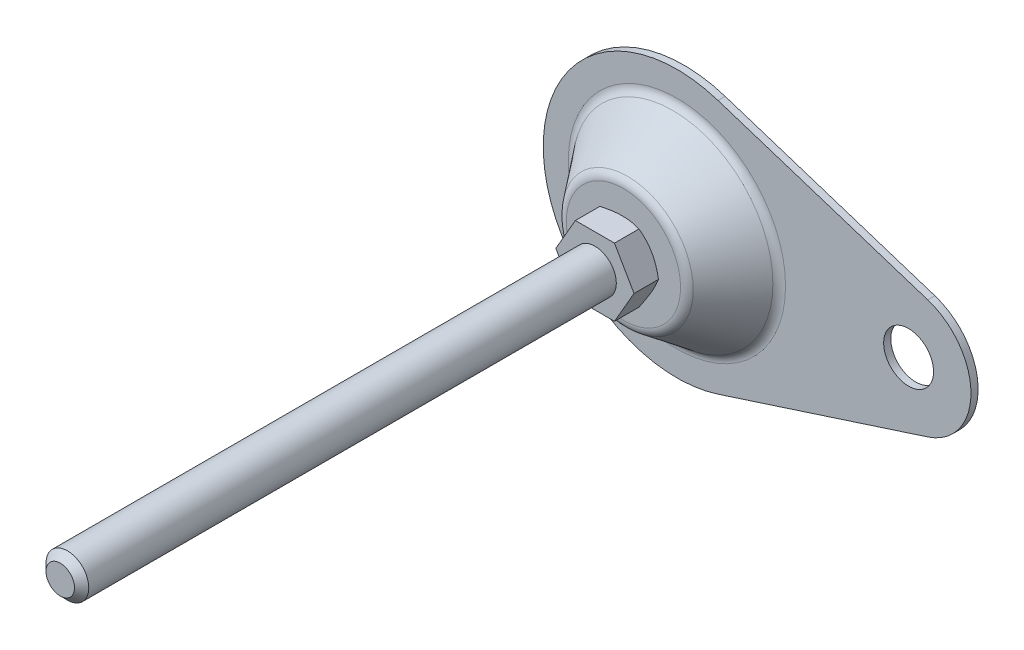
ISO-10303-21;
HEADER;
FILE_DESCRIPTION(('STEP AP214'),'2;1');
FILE_NAME('part.step','',(''),(''),'','','');
FILE_SCHEMA(('AUTOMOTIVE_DESIGN { 1 0 10303 214 1 1 1 1 }'));
ENDSEC;
DATA;
#1=APPLICATION_CONTEXT('core data for automotive mechanical design processes');
#2=APPLICATION_PROTOCOL_DEFINITION('international standard','automotive_design',2000,#1);
#3=PRODUCT_CONTEXT('',#1,'mechanical');
#4=PRODUCT('Part','Part','',(#3));
#5=PRODUCT_RELATED_PRODUCT_CATEGORY('part','',(#4));
#6=PRODUCT_DEFINITION_FORMATION('','',#4);
#7=PRODUCT_DEFINITION_CONTEXT('part definition',#1,'design');
#8=PRODUCT_DEFINITION('design','',#6,#7);
#9=PRODUCT_DEFINITION_SHAPE('','',#8);
#10=(LENGTH_UNIT() NAMED_UNIT(*) SI_UNIT(.MILLI.,.METRE.));
#11=(NAMED_UNIT(*) PLANE_ANGLE_UNIT() SI_UNIT($,.RADIAN.));
#12=(NAMED_UNIT(*) SI_UNIT($,.STERADIAN.) SOLID_ANGLE_UNIT());
#13=UNCERTAINTY_MEASURE_WITH_UNIT(LENGTH_MEASURE(1.E-05),#10,'distance_accuracy_value','');
#14=(GEOMETRIC_REPRESENTATION_CONTEXT(3) GLOBAL_UNCERTAINTY_ASSIGNED_CONTEXT((#13)) GLOBAL_UNIT_ASSIGNED_CONTEXT((#10,
#11,#12)) REPRESENTATION_CONTEXT('',''));
#15=CARTESIAN_POINT('',(0.,0.,0.));
#16=DIRECTION('',(0.,0.,1.));
#17=DIRECTION('',(1.,0.,0.));
#18=AXIS2_PLACEMENT_3D('',#15,#16,#17);
#19=CARTESIAN_POINT('',(65.,0.,2.));
#20=DIRECTION('',(0.,0.,1.));
#21=DIRECTION('',(1.,0.,0.));
#22=AXIS2_PLACEMENT_3D('',#19,#20,#21);
#23=PLANE('',#22);
#24=CARTESIAN_POINT('',(0.,0.,2.));
#25=DIRECTION('',(0.,0.,1.));
#26=DIRECTION('',(1.,0.,0.));
#27=AXIS2_PLACEMENT_3D('',#24,#25,#26);
#28=CIRCLE('',#27,30.4802116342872);
#29=CARTESIAN_POINT('',(30.4802116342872,0.,2.));
#30=VERTEX_POINT('',#29);
#31=EDGE_CURVE('E245',#30,#30,#28,.F.);
#32=ORIENTED_EDGE('',*,*,#31,.T.);
#33=EDGE_LOOP('',(#32));
#34=FACE_BOUND('',#33,.T.);
#35=CARTESIAN_POINT('',(65.,0.,2.));
#36=DIRECTION('',(0.,0.,1.));
#37=DIRECTION('',(1.,0.,0.));
#38=AXIS2_PLACEMENT_3D('',#35,#36,#37);
#39=CIRCLE('',#38,7.);
#40=CARTESIAN_POINT('',(72.,0.,2.));
#41=VERTEX_POINT('',#40);
#42=EDGE_CURVE('E262',#41,#41,#39,.T.);
#43=ORIENTED_EDGE('',*,*,#42,.F.);
#44=EDGE_LOOP('',(#43));
#45=FACE_BOUND('',#44,.T.);
#46=DIRECTION('',(-0.951485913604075,0.307692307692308,0.));
#47=VECTOR('',#46,1.);
#48=CARTESIAN_POINT('',(11.5384615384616,35.6807217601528,2.));
#49=LINE('',#48,#47);
#50=CARTESIAN_POINT('',(70.3846153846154,16.6510034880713,2.));
#51=VERTEX_POINT('',#50);
#52=CARTESIAN_POINT('',(11.5384615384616,35.6807217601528,2.));
#53=VERTEX_POINT('',#52);
#54=EDGE_CURVE('E112',#51,#53,#49,.T.);
#55=ORIENTED_EDGE('',*,*,#54,.T.);
#56=CARTESIAN_POINT('',(0.,0.,2.));
#57=DIRECTION('',(0.,0.,1.));
#58=DIRECTION('',(1.,0.,0.));
#59=AXIS2_PLACEMENT_3D('',#56,#57,#58);
#60=CIRCLE('',#59,37.5);
#61=CARTESIAN_POINT('',(11.5384615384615,-35.6807217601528,2.));
#62=VERTEX_POINT('',#61);
#63=EDGE_CURVE('E114',#53,#62,#60,.T.);
#64=ORIENTED_EDGE('',*,*,#63,.T.);
#65=DIRECTION('',(0.951485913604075,0.307692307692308,0.));
#66=VECTOR('',#65,1.);
#67=CARTESIAN_POINT('',(11.5384615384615,-35.6807217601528,2.));
#68=LINE('',#67,#66);
#69=CARTESIAN_POINT('',(70.3846153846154,-16.6510034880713,2.));
#70=VERTEX_POINT('',#69);
#71=EDGE_CURVE('E97',#62,#70,#68,.T.);
#72=ORIENTED_EDGE('',*,*,#71,.T.);
#73=CARTESIAN_POINT('',(65.,0.,2.));
#74=DIRECTION('',(0.,0.,1.));
#75=DIRECTION('',(1.,0.,0.));
#76=AXIS2_PLACEMENT_3D('',#73,#74,#75);
#77=CIRCLE('',#76,17.5);
#78=EDGE_CURVE('E106',#70,#51,#77,.T.);
#79=ORIENTED_EDGE('',*,*,#78,.T.);
#80=EDGE_LOOP('',(#55,#64,#72,#79));
#81=FACE_BOUND('',#80,.T.);
#82=ADVANCED_FACE('F14',(#34,#45,#81),#23,.T.);
#83=CARTESIAN_POINT('',(65.,0.,0.));
#84=DIRECTION('',(0.,0.,1.));
#85=DIRECTION('',(1.,0.,0.));
#86=AXIS2_PLACEMENT_3D('',#83,#84,#85);
#87=PLANE('',#86);
#88=CARTESIAN_POINT('',(65.,0.,0.));
#89=DIRECTION('',(0.,0.,1.));
#90=DIRECTION('',(1.,0.,0.));
#91=AXIS2_PLACEMENT_3D('',#88,#89,#90);
#92=CIRCLE('',#91,7.);
#93=CARTESIAN_POINT('',(72.,0.,0.));
#94=VERTEX_POINT('',#93);
#95=EDGE_CURVE('E258',#94,#94,#92,.T.);
#96=ORIENTED_EDGE('',*,*,#95,.T.);
#97=EDGE_LOOP('',(#96));
#98=FACE_BOUND('',#97,.T.);
#99=CARTESIAN_POINT('',(0.,0.,0.));
#100=DIRECTION('',(0.,0.,1.));
#101=DIRECTION('',(1.,0.,0.));
#102=AXIS2_PLACEMENT_3D('',#99,#100,#101);
#103=CIRCLE('',#102,37.5);
#104=CARTESIAN_POINT('',(11.5384615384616,35.6807217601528,0.));
#105=VERTEX_POINT('',#104);
#106=CARTESIAN_POINT('',(11.5384615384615,-35.6807217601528,0.));
#107=VERTEX_POINT('',#106);
#108=EDGE_CURVE('E275',#105,#107,#103,.T.);
#109=ORIENTED_EDGE('',*,*,#108,.F.);
#110=DIRECTION('',(-0.951485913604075,0.307692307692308,0.));
#111=VECTOR('',#110,1.);
#112=CARTESIAN_POINT('',(70.3846153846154,16.6510034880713,0.));
#113=LINE('',#112,#111);
#114=CARTESIAN_POINT('',(70.3846153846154,16.6510034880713,0.));
#115=VERTEX_POINT('',#114);
#116=EDGE_CURVE('E9',#115,#105,#113,.T.);
#117=ORIENTED_EDGE('',*,*,#116,.F.);
#118=CARTESIAN_POINT('',(65.,0.,0.));
#119=DIRECTION('',(0.,0.,1.));
#120=DIRECTION('',(1.,0.,0.));
#121=AXIS2_PLACEMENT_3D('',#118,#119,#120);
#122=CIRCLE('',#121,17.5);
#123=CARTESIAN_POINT('',(70.3846153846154,-16.6510034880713,0.));
#124=VERTEX_POINT('',#123);
#125=EDGE_CURVE('E22',#124,#115,#122,.T.);
#126=ORIENTED_EDGE('',*,*,#125,.F.);
#127=DIRECTION('',(0.951485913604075,0.307692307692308,0.));
#128=VECTOR('',#127,1.);
#129=CARTESIAN_POINT('',(70.3846153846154,-16.6510034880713,0.));
#130=LINE('',#129,#128);
#131=EDGE_CURVE('E99',#107,#124,#130,.T.);
#132=ORIENTED_EDGE('',*,*,#131,.F.);
#133=EDGE_LOOP('',(#109,#117,#126,#132));
#134=FACE_BOUND('',#133,.T.);
#135=ADVANCED_FACE('F215',(#98,#134),#87,.F.);
#136=CARTESIAN_POINT('',(0.,0.,17.));
#137=DIRECTION('',(0.,0.,-1.));
#138=DIRECTION('',(-1.,0.,0.));
#139=AXIS2_PLACEMENT_3D('',#136,#137,#138);
#140=PLANE('',#139);
#141=CARTESIAN_POINT('',(0.,0.,17.));
#142=DIRECTION('',(0.,0.,-1.));
#143=DIRECTION('',(-1.,0.,0.));
#144=AXIS2_PLACEMENT_3D('',#141,#142,#143);
#145=CIRCLE('',#144,9.);
#146=CARTESIAN_POINT('',(-9.,0.,17.));
#147=VERTEX_POINT('',#146);
#148=EDGE_CURVE('E122',#147,#147,#145,.T.);
#149=ORIENTED_EDGE('',*,*,#148,.T.);
#150=EDGE_LOOP('',(#149));
#151=FACE_BOUND('',#150,.T.);
#152=CARTESIAN_POINT('',(0.,0.,17.));
#153=DIRECTION('',(0.,0.,-1.));
#154=DIRECTION('',(-1.,0.,0.));
#155=AXIS2_PLACEMENT_3D('',#152,#153,#154);
#156=CIRCLE('',#155,16.0197883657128);
#157=CARTESIAN_POINT('',(-16.0197883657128,0.,17.));
#158=VERTEX_POINT('',#157);
#159=EDGE_CURVE('E278',#158,#158,#156,.F.);
#160=ORIENTED_EDGE('',*,*,#159,.T.);
#161=EDGE_LOOP('',(#160));
#162=FACE_BOUND('',#161,.T.);
#163=ADVANCED_FACE('F211',(#151,#162),#140,.F.);
#164=CARTESIAN_POINT('',(0.,0.,5.));
#165=DIRECTION('',(0.,0.,1.));
#166=DIRECTION('',(1.,0.,0.));
#167=AXIS2_PLACEMENT_3D('',#164,#165,#166);
#168=TOROIDAL_SURFACE('',#167,30.4802116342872,3.);
#169=CARTESIAN_POINT('',(0.,0.,3.1747053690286));
#170=DIRECTION('',(0.,0.,1.));
#171=DIRECTION('',(1.,0.,0.));
#172=AXIS2_PLACEMENT_3D('',#169,#170,#171);
#173=CIRCLE('',#172,28.0993925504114);
#174=CARTESIAN_POINT('',(28.0993925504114,0.,3.1747053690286));
#175=VERTEX_POINT('',#174);
#176=EDGE_CURVE('E242',#175,#175,#173,.T.);
#177=ORIENTED_EDGE('',*,*,#176,.F.);
#178=EDGE_LOOP('',(#177));
#179=FACE_BOUND('',#178,.T.);
#180=ORIENTED_EDGE('',*,*,#31,.F.);
#181=EDGE_LOOP('',(#180));
#182=FACE_BOUND('',#181,.T.);
#183=ADVANCED_FACE('F214',(#179,#182),#168,.F.);
#184=CARTESIAN_POINT('',(0.,0.,14.));
#185=DIRECTION('',(0.,0.,-1.));
#186=DIRECTION('',(-1.,0.,0.));
#187=AXIS2_PLACEMENT_3D('',#184,#185,#186);
#188=TOROIDAL_SURFACE('',#187,16.0197883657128,3.);
#189=ORIENTED_EDGE('',*,*,#159,.F.);
#190=EDGE_LOOP('',(#189));
#191=FACE_BOUND('',#190,.T.);
#192=CARTESIAN_POINT('',(0.,0.,15.8252946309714));
#193=DIRECTION('',(0.,0.,1.));
#194=DIRECTION('',(1.,0.,0.));
#195=AXIS2_PLACEMENT_3D('',#192,#193,#194);
#196=CIRCLE('',#195,18.4006074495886);
#197=CARTESIAN_POINT('',(18.4006074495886,0.,15.8252946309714));
#198=VERTEX_POINT('',#197);
#199=EDGE_CURVE('E251',#198,#198,#196,.F.);
#200=ORIENTED_EDGE('',*,*,#199,.F.);
#201=EDGE_LOOP('',(#200));
#202=FACE_BOUND('',#201,.T.);
#203=ADVANCED_FACE('F229',(#191,#202),#188,.T.);
#204=CARTESIAN_POINT('',(0.,0.,2.));
#205=DIRECTION('',(0.,0.,-1.));
#206=DIRECTION('',(-1.,0.,0.));
#207=AXIS2_PLACEMENT_3D('',#204,#205,#206);
#208=CYLINDRICAL_SURFACE('',#207,37.5);
#209=ORIENTED_EDGE('',*,*,#108,.T.);
#210=DIRECTION('',(0.,0.,1.));
#211=VECTOR('',#210,1.);
#212=CARTESIAN_POINT('',(11.5384615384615,-35.6807217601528,-8.));
#213=LINE('',#212,#211);
#214=EDGE_CURVE('E103',#107,#62,#213,.T.);
#215=ORIENTED_EDGE('',*,*,#214,.T.);
#216=ORIENTED_EDGE('',*,*,#63,.F.);
#217=DIRECTION('',(0.,0.,1.));
#218=VECTOR('',#217,1.);
#219=CARTESIAN_POINT('',(11.5384615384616,35.6807217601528,-8.));
#220=LINE('',#219,#218);
#221=EDGE_CURVE('E119',#105,#53,#220,.T.);
#222=ORIENTED_EDGE('',*,*,#221,.F.);
#223=EDGE_LOOP('',(#209,#215,#216,#222));
#224=FACE_BOUND('',#223,.T.);
#225=ADVANCED_FACE('F219',(#224),#208,.T.);
#226=CARTESIAN_POINT('',(65.,0.,2.));
#227=DIRECTION('',(0.,0.,-1.));
#228=DIRECTION('',(-1.,0.,0.));
#229=AXIS2_PLACEMENT_3D('',#226,#227,#228);
#230=CYLINDRICAL_SURFACE('',#229,7.);
#231=ORIENTED_EDGE('',*,*,#42,.T.);
#232=EDGE_LOOP('',(#231));
#233=FACE_BOUND('',#232,.T.);
#234=ORIENTED_EDGE('',*,*,#95,.F.);
#235=EDGE_LOOP('',(#234));
#236=FACE_BOUND('',#235,.T.);
#237=ADVANCED_FACE('F209',(#233,#236),#230,.F.);
#238=CARTESIAN_POINT('',(0.,0.,2.));
#239=DIRECTION('',(0.,0.,-1.));
#240=DIRECTION('',(-1.,0.,0.));
#241=AXIS2_PLACEMENT_3D('',#238,#239,#240);
#242=CONICAL_SURFACE('',#241,29.,0.654082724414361);
#243=ORIENTED_EDGE('',*,*,#176,.T.);
#244=EDGE_LOOP('',(#243));
#245=FACE_BOUND('',#244,.T.);
#246=ORIENTED_EDGE('',*,*,#199,.T.);
#247=EDGE_LOOP('',(#246));
#248=FACE_BOUND('',#247,.T.);
#249=ADVANCED_FACE('F151',(#245,#248),#242,.T.);
#250=CARTESIAN_POINT('',(0.,0.,17.));
#251=DIRECTION('',(0.,0.,1.));
#252=DIRECTION('',(1.,0.,0.));
#253=AXIS2_PLACEMENT_3D('',#250,#251,#252);
#254=CONICAL_SURFACE('',#253,9.,1.0471975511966);
#255=ORIENTED_EDGE('',*,*,#148,.F.);
#256=EDGE_LOOP('',(#255));
#257=FACE_BOUND('',#256,.T.);
#258=CARTESIAN_POINT('',(10.9697705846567,0.000200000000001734,18.137247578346));
#259=CARTESIAN_POINT('',(10.8492020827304,-0.2086307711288,18.0676485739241));
#260=CARTESIAN_POINT('',(10.7281840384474,-0.418240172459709,18.0012084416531));
#261=CARTESIAN_POINT('',(10.4851774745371,-0.839139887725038,17.8755224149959));
#262=CARTESIAN_POINT('',(10.3631886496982,-1.05043073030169,17.8162788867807));
#263=CARTESIAN_POINT('',(9.99525656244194,-1.68770779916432,17.6504897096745));
#264=CARTESIAN_POINT('',(9.74786083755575,-2.11620976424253,17.5561895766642));
#265=CARTESIAN_POINT('',(9.37764446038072,-2.75744333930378,17.4456138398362));
#266=CARTESIAN_POINT('',(9.2559298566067,-2.96825921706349,17.4141149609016));
#267=CARTESIAN_POINT('',(9.01193711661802,-3.39086703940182,17.3612933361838));
#268=CARTESIAN_POINT('',(8.88965896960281,-3.60265900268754,17.3399707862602));
#269=CARTESIAN_POINT('',(8.64489870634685,-4.02659621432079,17.3080481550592));
#270=CARTESIAN_POINT('',(8.52241700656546,-4.23874074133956,17.2974353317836));
#271=CARTESIAN_POINT('',(8.27734047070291,-4.66322575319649,17.2871576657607));
#272=CARTESIAN_POINT('',(8.15474563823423,-4.87556623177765,17.2874924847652));
#273=CARTESIAN_POINT('',(7.92555157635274,-5.27254199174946,17.2983485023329));
#274=CARTESIAN_POINT('',(7.81893617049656,-5.45720529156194,17.3075454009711));
#275=CARTESIAN_POINT('',(7.60595470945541,-5.82610000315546,17.3340405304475));
#276=CARTESIAN_POINT('',(7.49958867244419,-6.01033138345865,17.3513393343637));
#277=CARTESIAN_POINT('',(7.18090270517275,-6.56231167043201,17.414979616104));
#278=CARTESIAN_POINT('',(6.96914687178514,-6.92908353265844,17.4730570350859));
#279=CARTESIAN_POINT('',(6.5433889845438,-7.66651782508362,17.6182511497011));
#280=CARTESIAN_POINT('',(6.32944126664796,-8.03708614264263,17.7059833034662));
#281=CARTESIAN_POINT('',(5.90473630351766,-8.77269671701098,17.9050988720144));
#282=CARTESIAN_POINT('',(5.69397361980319,-9.137748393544,18.0164355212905));
#283=CARTESIAN_POINT('',(5.48471208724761,-9.5002,18.137247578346));
#284=B_SPLINE_CURVE_WITH_KNOTS('',3,(#258,#259,#260,#261,#262,#263,#264,#265,#266,#267,#268,
#269,#270,#271,#272,#273,#274,#275,#276,#277,#278,#279,#280,#281,#282,#283),.UNSPECIFIED.,.F.,
.F.,(4,2,2,2,2,2,2,2,2,2,2,2,4),(0.,0.752880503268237,1.50600787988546,3.0154687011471,
3.75167336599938,4.48789219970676,5.22323407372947,5.95855322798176,6.59868084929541,
7.23885375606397,8.52010929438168,9.82978009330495,11.1368800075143),.UNSPECIFIED.);
#285=CARTESIAN_POINT('',(10.9696551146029,0.,18.1371809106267));
#286=VERTEX_POINT('',#285);
#287=CARTESIAN_POINT('',(5.48482755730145,-9.5,18.1371809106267));
#288=VERTEX_POINT('',#287);
#289=EDGE_CURVE('E29',#286,#288,#284,.T.);
#290=ORIENTED_EDGE('',*,*,#289,.T.);
#291=CARTESIAN_POINT('',(-14.6955632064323,-9.5,21.9068104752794));
#292=CARTESIAN_POINT('',(-14.4882598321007,-9.5,21.806299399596));
#293=CARTESIAN_POINT('',(-14.2807121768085,-9.5,21.7062923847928));
#294=CARTESIAN_POINT('',(-13.8650773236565,-9.5,21.5074007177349));
#295=CARTESIAN_POINT('',(-13.656990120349,-9.5,21.4085160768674));
#296=CARTESIAN_POINT('',(-13.031786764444,-9.5,21.1136907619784));
#297=CARTESIAN_POINT('',(-12.6137907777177,-9.5,20.919608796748));
#298=CARTESIAN_POINT('',(-11.7726962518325,-9.5,20.5365293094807));
#299=CARTESIAN_POINT('',(-11.3495822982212,-9.5,20.3475655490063));
#300=CARTESIAN_POINT('',(-10.4999766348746,-9.5,19.9774183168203));
#301=CARTESIAN_POINT('',(-10.0734850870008,-9.5,19.796234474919));
#302=CARTESIAN_POINT('',(-9.20283547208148,-9.5,19.4381092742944));
#303=CARTESIAN_POINT('',(-8.75854626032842,-9.5,19.2614849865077));
#304=CARTESIAN_POINT('',(-7.86475734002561,-9.5,18.9216944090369));
#305=CARTESIAN_POINT('',(-7.41525705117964,-9.5,18.7585296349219));
#306=CARTESIAN_POINT('',(-6.51117876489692,-9.5,18.4499695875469));
#307=CARTESIAN_POINT('',(-6.05661328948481,-9.5,18.3045380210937));
#308=CARTESIAN_POINT('',(-5.14097860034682,-9.5,18.0361335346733));
#309=CARTESIAN_POINT('',(-4.67991149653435,-9.5,17.9131535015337));
#310=CARTESIAN_POINT('',(-3.75348023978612,-9.5,17.6962371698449));
#311=CARTESIAN_POINT('',(-3.28815355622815,-9.5,17.602145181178));
#312=CARTESIAN_POINT('',(-2.5859562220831,-9.5,17.4867668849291));
#313=CARTESIAN_POINT('',(-2.35117173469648,-9.5,17.4525991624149));
#314=CARTESIAN_POINT('',(-1.88044848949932,-9.5,17.393521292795));
#315=CARTESIAN_POINT('',(-1.64450984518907,-9.5,17.3686102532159));
#316=CARTESIAN_POINT('',(-1.1748605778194,-9.5,17.3288525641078));
#317=CARTESIAN_POINT('',(-0.941160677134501,-9.5,17.313879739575));
#318=CARTESIAN_POINT('',(-0.473337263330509,-9.5,17.2938276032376));
#319=CARTESIAN_POINT('',(-0.239213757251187,-9.5,17.2887481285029));
#320=CARTESIAN_POINT('',(0.229039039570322,-9.5,17.2886037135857));
#321=CARTESIAN_POINT('',(0.463168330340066,-9.5,17.2935388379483));
#322=CARTESIAN_POINT('',(0.931011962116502,-9.5,17.3133038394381));
#323=CARTESIAN_POINT('',(1.1647262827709,-9.5,17.328134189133));
#324=CARTESIAN_POINT('',(1.72753727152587,-9.5,17.3754490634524));
#325=CARTESIAN_POINT('',(2.05624094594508,-9.5,17.4126908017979));
#326=CARTESIAN_POINT('',(2.71118614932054,-9.5,17.5047105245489));
#327=CARTESIAN_POINT('',(3.03742733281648,-9.5,17.5594909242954));
#328=CARTESIAN_POINT('',(3.68714382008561,-9.5,17.684639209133));
#329=CARTESIAN_POINT('',(4.01061674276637,-9.5,17.755019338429));
#330=CARTESIAN_POINT('',(4.65430680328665,-9.5,17.9092217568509));
#331=CARTESIAN_POINT('',(4.97452399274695,-9.5,17.9930438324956));
#332=CARTESIAN_POINT('',(5.61874828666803,-9.5,18.1740751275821));
#333=CARTESIAN_POINT('',(5.94268344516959,-9.5,18.2715386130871));
#334=CARTESIAN_POINT('',(6.5873620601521,-9.5,18.4764513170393));
#335=CARTESIAN_POINT('',(6.90810549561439,-9.5,18.5839006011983));
#336=CARTESIAN_POINT('',(7.5465609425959,-9.5,18.8070861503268));
#337=CARTESIAN_POINT('',(7.86427394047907,-9.5,18.9228196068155));
#338=CARTESIAN_POINT('',(8.49707256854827,-9.5,19.161220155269));
#339=CARTESIAN_POINT('',(8.81215822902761,-9.5,19.2838871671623));
#340=CARTESIAN_POINT('',(9.55396997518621,-9.5,19.5805861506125));
#341=CARTESIAN_POINT('',(9.97970205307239,-9.5,19.7570995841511));
#342=CARTESIAN_POINT('',(10.8275699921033,-9.5,20.1185863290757));
#343=CARTESIAN_POINT('',(11.249705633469,-9.5,20.3035601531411));
#344=CARTESIAN_POINT('',(12.0910495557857,-9.5,20.6802762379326));
#345=CARTESIAN_POINT('',(12.5102571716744,-9.5,20.8720199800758));
#346=CARTESIAN_POINT('',(13.3461406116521,-9.5,21.2609129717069));
#347=CARTESIAN_POINT('',(13.7628164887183,-9.5,21.4580621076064));
#348=CARTESIAN_POINT('',(14.5945052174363,-9.5,21.8569725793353));
#349=CARTESIAN_POINT('',(15.0095157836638,-9.5,22.0587386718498));
#350=CARTESIAN_POINT('',(15.8377576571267,-9.5,22.4658896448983));
#351=CARTESIAN_POINT('',(16.2509889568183,-9.5,22.6712745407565));
#352=CARTESIAN_POINT('',(17.0758929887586,-9.5,23.085017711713));
#353=CARTESIAN_POINT('',(17.4875659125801,-9.5,23.2933756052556));
#354=CARTESIAN_POINT('',(18.3096306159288,-9.5,23.7126049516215));
#355=CARTESIAN_POINT('',(18.7200223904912,-9.5,23.9234764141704));
#356=CARTESIAN_POINT('',(19.8810904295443,-9.5,24.52385449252));
#357=CARTESIAN_POINT('',(20.63047802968,-9.5,24.9158532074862));
#358=CARTESIAN_POINT('',(22.1264804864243,-9.5,25.7051565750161));
#359=CARTESIAN_POINT('',(22.8730952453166,-9.5,26.1024614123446));
#360=CARTESIAN_POINT('',(24.362315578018,-9.5,26.9001541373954));
#361=CARTESIAN_POINT('',(25.1049264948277,-9.5,27.300532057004));
#362=CARTESIAN_POINT('',(26.2175344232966,-9.5,27.903462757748));
#363=CARTESIAN_POINT('',(26.5881758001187,-9.5,28.1048282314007));
#364=CARTESIAN_POINT('',(27.3290716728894,-9.5,28.5082683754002));
#365=CARTESIAN_POINT('',(27.6993261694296,-9.5,28.7103430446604));
#366=CARTESIAN_POINT('',(28.069409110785,-9.5,28.9127315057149));
#367=B_SPLINE_CURVE_WITH_KNOTS('',3,(#291,#292,#293,#294,#295,#296,#297,#298,#299,#300,#301,
#302,#303,#304,#305,#306,#307,#308,#309,#310,#311,#312,#313,#314,#315,#316,#317,#318,#319,#320,
#321,#322,#323,#324,#325,#326,#327,#328,#329,#330,#331,#332,#333,#334,#335,#336,#337,#338,#339,
#340,#341,#342,#343,#344,#345,#346,#347,#348,#349,#350,#351,#352,#353,#354,#355,#356,#357,#358,
#359,#360,#361,#362,#363,#364,#365,#366),.UNSPECIFIED.,.F.,.F.,(4,2,2,2,2,2,2,2,2,2,2,2,2,2,2,2,
2,2,2,2,2,2,2,2,2,2,2,2,2,2,2,2,2,2,2,2,2,4),(0.,0.691153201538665,1.38231340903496,
2.76484033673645,4.15495701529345,5.54500747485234,6.97916797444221,8.41348974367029,
9.84482488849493,11.2757057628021,12.6987338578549,13.4103530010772,14.121903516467,
14.8242380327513,15.5265609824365,16.2288884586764,16.9312494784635,17.9231198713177,
18.9151269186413,19.9079153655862,20.9006880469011,21.9153343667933,22.929987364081,
23.9442979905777,24.9585969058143,26.3410946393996,27.7236762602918,29.1065623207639,
30.4894193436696,31.8737716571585,33.2581298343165,34.6423119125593,36.0264993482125,
38.5636315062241,41.1008522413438,43.6318417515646,44.8972690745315,46.1626944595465),.UNSPECIFIED.);
#368=CARTESIAN_POINT('',(-5.48482755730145,-9.5,18.1371809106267));
#369=VERTEX_POINT('',#368);
#370=EDGE_CURVE('E158',#288,#369,#367,.F.);
#371=ORIENTED_EDGE('',*,*,#370,.T.);
#372=CARTESIAN_POINT('',(-5.48471208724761,-9.5002,18.137247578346));
#373=CARTESIAN_POINT('',(-5.6052805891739,-9.29136922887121,18.0676485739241));
#374=CARTESIAN_POINT('',(-5.72629863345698,-9.0817598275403,18.0012084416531));
#375=CARTESIAN_POINT('',(-5.96930519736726,-8.66086011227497,17.8755224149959));
#376=CARTESIAN_POINT('',(-6.09129402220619,-8.44956926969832,17.8162788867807));
#377=CARTESIAN_POINT('',(-6.45922610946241,-7.81229220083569,17.6504897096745));
#378=CARTESIAN_POINT('',(-6.70662183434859,-7.38379023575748,17.5561895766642));
#379=CARTESIAN_POINT('',(-7.07683821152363,-6.74255666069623,17.4456138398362));
#380=CARTESIAN_POINT('',(-7.19855281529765,-6.53174078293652,17.4141149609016));
#381=CARTESIAN_POINT('',(-7.44254555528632,-6.10913296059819,17.3612933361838));
#382=CARTESIAN_POINT('',(-7.56482370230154,-5.89734099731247,17.3399707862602));
#383=CARTESIAN_POINT('',(-7.80958396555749,-5.47340378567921,17.3080481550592));
#384=CARTESIAN_POINT('',(-7.93206566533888,-5.26125925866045,17.2974353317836));
#385=CARTESIAN_POINT('',(-8.17714220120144,-4.83677424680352,17.2871576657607));
#386=CARTESIAN_POINT('',(-8.29973703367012,-4.62443376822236,17.2874924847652));
#387=CARTESIAN_POINT('',(-8.52893109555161,-4.22745800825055,17.2983485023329));
#388=CARTESIAN_POINT('',(-8.63554650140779,-4.04279470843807,17.3075454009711));
#389=CARTESIAN_POINT('',(-8.84852796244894,-3.67389999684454,17.3340405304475));
#390=CARTESIAN_POINT('',(-8.95489399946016,-3.48966861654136,17.3513393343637));
#391=CARTESIAN_POINT('',(-9.27357996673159,-2.937688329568,17.414979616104));
#392=CARTESIAN_POINT('',(-9.48533580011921,-2.57091646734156,17.473057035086));
#393=CARTESIAN_POINT('',(-9.91109368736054,-1.83348217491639,17.6182511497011));
#394=CARTESIAN_POINT('',(-10.1250414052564,-1.46291385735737,17.7059833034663));
#395=CARTESIAN_POINT('',(-10.5497463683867,-0.727303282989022,17.9050988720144));
#396=CARTESIAN_POINT('',(-10.7605090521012,-0.362251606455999,18.0164355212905));
#397=CARTESIAN_POINT('',(-10.9697705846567,0.00019999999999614,18.137247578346));
#398=B_SPLINE_CURVE_WITH_KNOTS('',3,(#372,#373,#374,#375,#376,#377,#378,#379,#380,#381,#382,
#383,#384,#385,#386,#387,#388,#389,#390,#391,#392,#393,#394,#395,#396,#397),.UNSPECIFIED.,.F.,
.F.,(4,2,2,2,2,2,2,2,2,2,2,2,4),(0.,0.752880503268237,1.50600787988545,3.0154687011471,
3.75167336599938,4.48789219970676,5.22323407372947,5.95855322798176,6.59868084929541,
7.23885375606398,8.52010929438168,9.82978009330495,11.1368800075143),.UNSPECIFIED.);
#399=CARTESIAN_POINT('',(-10.9696551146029,0.,18.1371809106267));
#400=VERTEX_POINT('',#399);
#401=EDGE_CURVE('E127',#369,#400,#398,.T.);
#402=ORIENTED_EDGE('',*,*,#401,.T.);
#403=CARTESIAN_POINT('',(-10.9697705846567,-0.000200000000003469,18.137247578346));
#404=CARTESIAN_POINT('',(-10.8492020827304,0.208630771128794,18.0676485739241));
#405=CARTESIAN_POINT('',(-10.7281840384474,0.418240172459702,18.0012084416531));
#406=CARTESIAN_POINT('',(-10.4851774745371,0.839139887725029,17.8755224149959));
#407=CARTESIAN_POINT('',(-10.3631886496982,1.05043073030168,17.8162788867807));
#408=CARTESIAN_POINT('',(-9.99525656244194,1.68770779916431,17.6504897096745));
#409=CARTESIAN_POINT('',(-9.74786083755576,2.11620976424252,17.5561895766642));
#410=CARTESIAN_POINT('',(-9.37764446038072,2.75744333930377,17.4456138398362));
#411=CARTESIAN_POINT('',(-9.2559298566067,2.96825921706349,17.4141149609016));
#412=CARTESIAN_POINT('',(-9.01193711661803,3.39086703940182,17.3612933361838));
#413=CARTESIAN_POINT('',(-8.88965896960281,3.60265900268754,17.3399707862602));
#414=CARTESIAN_POINT('',(-8.64489870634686,4.02659621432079,17.3080481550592));
#415=CARTESIAN_POINT('',(-8.52241700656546,4.23874074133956,17.2974353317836));
#416=CARTESIAN_POINT('',(-8.27734047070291,4.66322575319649,17.2871576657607));
#417=CARTESIAN_POINT('',(-8.15474563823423,4.87556623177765,17.2874924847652));
#418=CARTESIAN_POINT('',(-7.92555157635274,5.27254199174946,17.2983485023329));
#419=CARTESIAN_POINT('',(-7.81893617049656,5.45720529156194,17.3075454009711));
#420=CARTESIAN_POINT('',(-7.60595470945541,5.82610000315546,17.3340405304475));
#421=CARTESIAN_POINT('',(-7.49958867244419,6.01033138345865,17.3513393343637));
#422=CARTESIAN_POINT('',(-7.18090270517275,6.56231167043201,17.414979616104));
#423=CARTESIAN_POINT('',(-6.96914687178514,6.92908353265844,17.4730570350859));
#424=CARTESIAN_POINT('',(-6.5433889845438,7.66651782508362,17.6182511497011));
#425=CARTESIAN_POINT('',(-6.32944126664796,8.03708614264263,17.7059833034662));
#426=CARTESIAN_POINT('',(-5.90473630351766,8.77269671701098,17.9050988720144));
#427=CARTESIAN_POINT('',(-5.69397361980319,9.137748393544,18.0164355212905));
#428=CARTESIAN_POINT('',(-5.48471208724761,9.5002,18.137247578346));
#429=B_SPLINE_CURVE_WITH_KNOTS('',3,(#403,#404,#405,#406,#407,#408,#409,#410,#411,#412,#413,
#414,#415,#416,#417,#418,#419,#420,#421,#422,#423,#424,#425,#426,#427,#428),.UNSPECIFIED.,.F.,
.F.,(4,2,2,2,2,2,2,2,2,2,2,2,4),(0.,0.752880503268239,1.50600787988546,3.01546870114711,
3.75167336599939,4.48789219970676,5.22323407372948,5.95855322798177,6.59868084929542,
7.23885375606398,8.52010929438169,9.82978009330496,11.1368800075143),.UNSPECIFIED.);
#430=CARTESIAN_POINT('',(-5.48482755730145,9.5,18.1371809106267));
#431=VERTEX_POINT('',#430);
#432=EDGE_CURVE('E135',#400,#431,#429,.T.);
#433=ORIENTED_EDGE('',*,*,#432,.T.);
#434=CARTESIAN_POINT('',(-14.6955632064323,9.5,21.9068104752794));
#435=CARTESIAN_POINT('',(-14.4882598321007,9.5,21.806299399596));
#436=CARTESIAN_POINT('',(-14.2807121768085,9.5,21.7062923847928));
#437=CARTESIAN_POINT('',(-13.8650773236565,9.5,21.5074007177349));
#438=CARTESIAN_POINT('',(-13.656990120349,9.5,21.4085160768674));
#439=CARTESIAN_POINT('',(-13.031786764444,9.5,21.1136907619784));
#440=CARTESIAN_POINT('',(-12.6137907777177,9.5,20.919608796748));
#441=CARTESIAN_POINT('',(-11.7726962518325,9.5,20.5365293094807));
#442=CARTESIAN_POINT('',(-11.3495822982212,9.5,20.3475655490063));
#443=CARTESIAN_POINT('',(-10.4999766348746,9.5,19.9774183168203));
#444=CARTESIAN_POINT('',(-10.0734850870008,9.5,19.796234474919));
#445=CARTESIAN_POINT('',(-9.20283547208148,9.5,19.4381092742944));
#446=CARTESIAN_POINT('',(-8.75854626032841,9.5,19.2614849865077));
#447=CARTESIAN_POINT('',(-7.86475734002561,9.5,18.9216944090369));
#448=CARTESIAN_POINT('',(-7.41525705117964,9.5,18.7585296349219));
#449=CARTESIAN_POINT('',(-6.51117876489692,9.5,18.4499695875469));
#450=CARTESIAN_POINT('',(-6.05661328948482,9.5,18.3045380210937));
#451=CARTESIAN_POINT('',(-5.14097860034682,9.5,18.0361335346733));
#452=CARTESIAN_POINT('',(-4.67991149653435,9.5,17.9131535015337));
#453=CARTESIAN_POINT('',(-3.75348023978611,9.5,17.6962371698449));
#454=CARTESIAN_POINT('',(-3.28815355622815,9.5,17.602145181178));
#455=CARTESIAN_POINT('',(-2.5859562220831,9.5,17.4867668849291));
#456=CARTESIAN_POINT('',(-2.35117173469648,9.5,17.4525991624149));
#457=CARTESIAN_POINT('',(-1.88044848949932,9.5,17.393521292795));
#458=CARTESIAN_POINT('',(-1.64450984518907,9.5,17.3686102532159));
#459=CARTESIAN_POINT('',(-1.1748605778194,9.5,17.3288525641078));
#460=CARTESIAN_POINT('',(-0.941160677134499,9.5,17.313879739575));
#461=CARTESIAN_POINT('',(-0.473337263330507,9.5,17.2938276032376));
#462=CARTESIAN_POINT('',(-0.239213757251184,9.5,17.2887481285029));
#463=CARTESIAN_POINT('',(0.229039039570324,9.5,17.2886037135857));
#464=CARTESIAN_POINT('',(0.463168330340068,9.5,17.2935388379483));
#465=CARTESIAN_POINT('',(0.931011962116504,9.5,17.3133038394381));
#466=CARTESIAN_POINT('',(1.1647262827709,9.5,17.328134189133));
#467=CARTESIAN_POINT('',(1.72753727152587,9.5,17.3754490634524));
#468=CARTESIAN_POINT('',(2.05624094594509,9.5,17.4126908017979));
#469=CARTESIAN_POINT('',(2.71118614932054,9.5,17.5047105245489));
#470=CARTESIAN_POINT('',(3.03742733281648,9.5,17.5594909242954));
#471=CARTESIAN_POINT('',(3.68714382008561,9.5,17.684639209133));
#472=CARTESIAN_POINT('',(4.01061674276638,9.5,17.755019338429));
#473=CARTESIAN_POINT('',(4.65430680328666,9.5,17.9092217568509));
#474=CARTESIAN_POINT('',(4.97452399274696,9.5,17.9930438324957));
#475=CARTESIAN_POINT('',(5.61874828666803,9.5,18.1740751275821));
#476=CARTESIAN_POINT('',(5.9426834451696,9.5,18.2715386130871));
#477=CARTESIAN_POINT('',(6.5873620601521,9.5,18.4764513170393));
#478=CARTESIAN_POINT('',(6.90810549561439,9.5,18.5839006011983));
#479=CARTESIAN_POINT('',(7.5465609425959,9.5,18.8070861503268));
#480=CARTESIAN_POINT('',(7.86427394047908,9.5,18.9228196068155));
#481=CARTESIAN_POINT('',(8.49707256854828,9.5,19.161220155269));
#482=CARTESIAN_POINT('',(8.81215822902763,9.5,19.2838871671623));
#483=CARTESIAN_POINT('',(9.55396997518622,9.5,19.5805861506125));
#484=CARTESIAN_POINT('',(9.9797020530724,9.5,19.7570995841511));
#485=CARTESIAN_POINT('',(10.8275699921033,9.5,20.1185863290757));
#486=CARTESIAN_POINT('',(11.249705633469,9.5,20.3035601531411));
#487=CARTESIAN_POINT('',(12.0910495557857,9.5,20.6802762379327));
#488=CARTESIAN_POINT('',(12.5102571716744,9.5,20.8720199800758));
#489=CARTESIAN_POINT('',(13.3461406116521,9.5,21.2609129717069));
#490=CARTESIAN_POINT('',(13.7628164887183,9.5,21.4580621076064));
#491=CARTESIAN_POINT('',(14.5945052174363,9.5,21.8569725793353));
#492=CARTESIAN_POINT('',(15.0095157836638,9.5,22.0587386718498));
#493=CARTESIAN_POINT('',(15.8377576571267,9.5,22.4658896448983));
#494=CARTESIAN_POINT('',(16.2509889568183,9.5,22.6712745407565));
#495=CARTESIAN_POINT('',(17.0758929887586,9.5,23.085017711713));
#496=CARTESIAN_POINT('',(17.4875659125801,9.5,23.2933756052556));
#497=CARTESIAN_POINT('',(18.3096306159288,9.5,23.7126049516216));
#498=CARTESIAN_POINT('',(18.7200223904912,9.5,23.9234764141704));
#499=CARTESIAN_POINT('',(19.8810904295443,9.5,24.52385449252));
#500=CARTESIAN_POINT('',(20.63047802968,9.5,24.9158532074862));
#501=CARTESIAN_POINT('',(22.1264804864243,9.5,25.7051565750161));
#502=CARTESIAN_POINT('',(22.8730952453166,9.5,26.1024614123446));
#503=CARTESIAN_POINT('',(24.362315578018,9.5,26.9001541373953));
#504=CARTESIAN_POINT('',(25.1049264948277,9.5,27.300532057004));
#505=CARTESIAN_POINT('',(26.2175344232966,9.5,27.903462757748));
#506=CARTESIAN_POINT('',(26.5881758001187,9.5,28.1048282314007));
#507=CARTESIAN_POINT('',(27.3290716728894,9.5,28.5082683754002));
#508=CARTESIAN_POINT('',(27.6993261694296,9.5,28.7103430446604));
#509=CARTESIAN_POINT('',(28.069409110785,9.5,28.9127315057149));
#510=B_SPLINE_CURVE_WITH_KNOTS('',3,(#434,#435,#436,#437,#438,#439,#440,#441,#442,#443,#444,
#445,#446,#447,#448,#449,#450,#451,#452,#453,#454,#455,#456,#457,#458,#459,#460,#461,#462,#463,
#464,#465,#466,#467,#468,#469,#470,#471,#472,#473,#474,#475,#476,#477,#478,#479,#480,#481,#482,
#483,#484,#485,#486,#487,#488,#489,#490,#491,#492,#493,#494,#495,#496,#497,#498,#499,#500,#501,
#502,#503,#504,#505,#506,#507,#508,#509),.UNSPECIFIED.,.F.,.F.,(4,2,2,2,2,2,2,2,2,2,2,2,2,2,2,2,
2,2,2,2,2,2,2,2,2,2,2,2,2,2,2,2,2,2,2,2,2,4),(0.,0.691153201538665,1.38231340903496,
2.76484033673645,4.15495701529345,5.54500747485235,6.97916797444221,8.41348974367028,
9.84482488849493,11.2757057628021,12.6987338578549,13.4103530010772,14.121903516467,
14.8242380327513,15.5265609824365,16.2288884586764,16.9312494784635,17.9231198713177,
18.9151269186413,19.9079153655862,20.9006880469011,21.9153343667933,22.929987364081,
23.9442979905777,24.9585969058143,26.3410946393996,27.7236762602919,29.1065623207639,
30.4894193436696,31.8737716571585,33.2581298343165,34.6423119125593,36.0264993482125,
38.5636315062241,41.1008522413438,43.6318417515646,44.8972690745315,46.1626944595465),.UNSPECIFIED.);
#511=CARTESIAN_POINT('',(5.48482755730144,9.5,18.1371809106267));
#512=VERTEX_POINT('',#511);
#513=EDGE_CURVE('E169',#431,#512,#510,.T.);
#514=ORIENTED_EDGE('',*,*,#513,.T.);
#515=CARTESIAN_POINT('',(5.48471208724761,9.5002,18.137247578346));
#516=CARTESIAN_POINT('',(5.6052805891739,9.29136922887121,18.0676485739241));
#517=CARTESIAN_POINT('',(5.72629863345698,9.0817598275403,18.0012084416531));
#518=CARTESIAN_POINT('',(5.96930519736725,8.66086011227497,17.8755224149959));
#519=CARTESIAN_POINT('',(6.09129402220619,8.44956926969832,17.8162788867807));
#520=CARTESIAN_POINT('',(6.4592261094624,7.81229220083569,17.6504897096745));
#521=CARTESIAN_POINT('',(6.70662183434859,7.38379023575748,17.5561895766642));
#522=CARTESIAN_POINT('',(7.07683821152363,6.74255666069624,17.4456138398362));
#523=CARTESIAN_POINT('',(7.19855281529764,6.53174078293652,17.4141149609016));
#524=CARTESIAN_POINT('',(7.44254555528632,6.10913296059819,17.3612933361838));
#525=CARTESIAN_POINT('',(7.56482370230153,5.89734099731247,17.3399707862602));
#526=CARTESIAN_POINT('',(7.80958396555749,5.47340378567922,17.3080481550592));
#527=CARTESIAN_POINT('',(7.93206566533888,5.26125925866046,17.2974353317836));
#528=CARTESIAN_POINT('',(8.17714220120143,4.83677424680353,17.2871576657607));
#529=CARTESIAN_POINT('',(8.29973703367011,4.62443376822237,17.2874924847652));
#530=CARTESIAN_POINT('',(8.5289310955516,4.22745800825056,17.2983485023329));
#531=CARTESIAN_POINT('',(8.63554650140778,4.04279470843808,17.3075454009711));
#532=CARTESIAN_POINT('',(8.84852796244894,3.67389999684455,17.3340405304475));
#533=CARTESIAN_POINT('',(8.95489399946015,3.48966861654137,17.3513393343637));
#534=CARTESIAN_POINT('',(9.27357996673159,2.93768832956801,17.414979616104));
#535=CARTESIAN_POINT('',(9.4853358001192,2.57091646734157,17.473057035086));
#536=CARTESIAN_POINT('',(9.91109368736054,1.8334821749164,17.6182511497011));
#537=CARTESIAN_POINT('',(10.1250414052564,1.46291385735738,17.7059833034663));
#538=CARTESIAN_POINT('',(10.5497463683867,0.727303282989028,17.9050988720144));
#539=CARTESIAN_POINT('',(10.7605090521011,0.362251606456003,18.0164355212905));
#540=CARTESIAN_POINT('',(10.9697705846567,-0.000199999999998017,18.137247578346));
#541=B_SPLINE_CURVE_WITH_KNOTS('',3,(#515,#516,#517,#518,#519,#520,#521,#522,#523,#524,#525,
#526,#527,#528,#529,#530,#531,#532,#533,#534,#535,#536,#537,#538,#539,#540),.UNSPECIFIED.,.F.,
.F.,(4,2,2,2,2,2,2,2,2,2,2,2,4),(0.,0.752880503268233,1.50600787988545,3.0154687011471,
3.75167336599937,4.48789219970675,5.22323407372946,5.95855322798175,6.5986808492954,
7.23885375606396,8.52010929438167,9.82978009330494,11.1368800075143),.UNSPECIFIED.);
#542=EDGE_CURVE('E176',#512,#286,#541,.T.);
#543=ORIENTED_EDGE('',*,*,#542,.T.);
#544=EDGE_LOOP('',(#290,#371,#402,#433,#514,#543));
#545=FACE_BOUND('',#544,.T.);
#546=ADVANCED_FACE('F145',(#257,#545),#254,.T.);
#547=CARTESIAN_POINT('',(0.,0.,175.));
#548=DIRECTION('',(0.,0.,1.));
#549=DIRECTION('',(1.,0.,0.));
#550=AXIS2_PLACEMENT_3D('',#547,#548,#549);
#551=PLANE('',#550);
#552=CARTESIAN_POINT('',(0.,0.,175.));
#553=DIRECTION('',(0.,0.,1.));
#554=DIRECTION('',(1.,0.,0.));
#555=AXIS2_PLACEMENT_3D('',#552,#553,#554);
#556=CIRCLE('',#555,4.);
#557=CARTESIAN_POINT('',(4.,0.,175.));
#558=VERTEX_POINT('',#557);
#559=EDGE_CURVE('E246',#558,#558,#556,.T.);
#560=ORIENTED_EDGE('',*,*,#559,.T.);
#561=EDGE_LOOP('',(#560));
#562=FACE_BOUND('',#561,.T.);
#563=ADVANCED_FACE('F150',(#562),#551,.T.);
#564=CARTESIAN_POINT('',(0.,0.,175.));
#565=DIRECTION('',(0.,0.,-1.));
#566=DIRECTION('',(-1.,0.,0.));
#567=AXIS2_PLACEMENT_3D('',#564,#565,#566);
#568=CONICAL_SURFACE('',#567,4.,0.785398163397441);
#569=CARTESIAN_POINT('',(0.,0.,173.));
#570=DIRECTION('',(0.,0.,1.));
#571=DIRECTION('',(1.,0.,0.));
#572=AXIS2_PLACEMENT_3D('',#569,#570,#571);
#573=CIRCLE('',#572,6.);
#574=CARTESIAN_POINT('',(6.,0.,173.));
#575=VERTEX_POINT('',#574);
#576=EDGE_CURVE('E249',#575,#575,#573,.F.);
#577=ORIENTED_EDGE('',*,*,#576,.F.);
#578=EDGE_LOOP('',(#577));
#579=FACE_BOUND('',#578,.T.);
#580=ORIENTED_EDGE('',*,*,#559,.F.);
#581=EDGE_LOOP('',(#580));
#582=FACE_BOUND('',#581,.T.);
#583=ADVANCED_FACE('F16',(#579,#582),#568,.T.);
#584=CARTESIAN_POINT('',(0.,0.,175.));
#585=DIRECTION('',(0.,0.,-1.));
#586=DIRECTION('',(-1.,0.,0.));
#587=AXIS2_PLACEMENT_3D('',#584,#585,#586);
#588=CYLINDRICAL_SURFACE('',#587,6.);
#589=CARTESIAN_POINT('',(0.,0.,25.));
#590=DIRECTION('',(0.,0.,1.));
#591=DIRECTION('',(1.,0.,0.));
#592=AXIS2_PLACEMENT_3D('',#589,#590,#591);
#593=CIRCLE('',#592,6.);
#594=CARTESIAN_POINT('',(6.,0.,25.));
#595=VERTEX_POINT('',#594);
#596=EDGE_CURVE('E256',#595,#595,#593,.T.);
#597=ORIENTED_EDGE('',*,*,#596,.T.);
#598=EDGE_LOOP('',(#597));
#599=FACE_BOUND('',#598,.T.);
#600=ORIENTED_EDGE('',*,*,#576,.T.);
#601=EDGE_LOOP('',(#600));
#602=FACE_BOUND('',#601,.T.);
#603=ADVANCED_FACE('F203',(#599,#602),#588,.T.);
#604=CARTESIAN_POINT('',(0.,0.,25.));
#605=DIRECTION('',(0.,0.,1.));
#606=DIRECTION('',(1.,0.,0.));
#607=AXIS2_PLACEMENT_3D('',#604,#605,#606);
#608=PLANE('',#607);
#609=DIRECTION('',(0.5,0.866025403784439,0.));
#610=VECTOR('',#609,1.);
#611=CARTESIAN_POINT('',(5.48482755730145,-9.5,25.));
#612=LINE('',#611,#610);
#613=CARTESIAN_POINT('',(5.48482755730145,-9.5,25.));
#614=VERTEX_POINT('',#613);
#615=CARTESIAN_POINT('',(10.9696551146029,0.,25.));
#616=VERTEX_POINT('',#615);
#617=EDGE_CURVE('E320',#614,#616,#612,.T.);
#618=ORIENTED_EDGE('',*,*,#617,.T.);
#619=DIRECTION('',(-0.5,0.866025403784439,0.));
#620=VECTOR('',#619,1.);
#621=CARTESIAN_POINT('',(10.9696551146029,0.,25.));
#622=LINE('',#621,#620);
#623=CARTESIAN_POINT('',(5.48482755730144,9.5,25.));
#624=VERTEX_POINT('',#623);
#625=EDGE_CURVE('E319',#616,#624,#622,.T.);
#626=ORIENTED_EDGE('',*,*,#625,.T.);
#627=DIRECTION('',(-1.,0.,0.));
#628=VECTOR('',#627,1.);
#629=CARTESIAN_POINT('',(5.48482755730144,9.5,25.));
#630=LINE('',#629,#628);
#631=CARTESIAN_POINT('',(-5.48482755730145,9.5,25.));
#632=VERTEX_POINT('',#631);
#633=EDGE_CURVE('E317',#624,#632,#630,.T.);
#634=ORIENTED_EDGE('',*,*,#633,.T.);
#635=DIRECTION('',(-0.5,-0.866025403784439,0.));
#636=VECTOR('',#635,1.);
#637=CARTESIAN_POINT('',(-5.48482755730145,9.5,25.));
#638=LINE('',#637,#636);
#639=CARTESIAN_POINT('',(-10.9696551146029,0.,25.));
#640=VERTEX_POINT('',#639);
#641=EDGE_CURVE('E313',#632,#640,#638,.T.);
#642=ORIENTED_EDGE('',*,*,#641,.T.);
#643=DIRECTION('',(0.5,-0.866025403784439,0.));
#644=VECTOR('',#643,1.);
#645=CARTESIAN_POINT('',(-10.9696551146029,0.,25.));
#646=LINE('',#645,#644);
#647=CARTESIAN_POINT('',(-5.48482755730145,-9.5,25.));
#648=VERTEX_POINT('',#647);
#649=EDGE_CURVE('E327',#640,#648,#646,.T.);
#650=ORIENTED_EDGE('',*,*,#649,.T.);
#651=DIRECTION('',(1.,0.,0.));
#652=VECTOR('',#651,1.);
#653=CARTESIAN_POINT('',(-5.48482755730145,-9.5,25.));
#654=LINE('',#653,#652);
#655=EDGE_CURVE('E37',#648,#614,#654,.T.);
#656=ORIENTED_EDGE('',*,*,#655,.T.);
#657=EDGE_LOOP('',(#618,#626,#634,#642,#650,#656));
#658=FACE_BOUND('',#657,.T.);
#659=ORIENTED_EDGE('',*,*,#596,.F.);
#660=EDGE_LOOP('',(#659));
#661=FACE_BOUND('',#660,.T.);
#662=ADVANCED_FACE('F154',(#658,#661),#608,.T.);
#663=CARTESIAN_POINT('',(-5.48482755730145,-9.5,25.));
#664=DIRECTION('',(0.,1.,0.));
#665=DIRECTION('',(0.,0.,1.));
#666=AXIS2_PLACEMENT_3D('',#663,#664,#665);
#667=PLANE('',#666);
#668=ORIENTED_EDGE('',*,*,#370,.F.);
#669=DIRECTION('',(0.,0.,-1.));
#670=VECTOR('',#669,1.);
#671=CARTESIAN_POINT('',(5.48482755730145,-9.5,25.));
#672=LINE('',#671,#670);
#673=EDGE_CURVE('E303',#614,#288,#672,.T.);
#674=ORIENTED_EDGE('',*,*,#673,.F.);
#675=ORIENTED_EDGE('',*,*,#655,.F.);
#676=DIRECTION('',(0.,0.,-1.));
#677=VECTOR('',#676,1.);
#678=CARTESIAN_POINT('',(-5.48482755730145,-9.5,25.));
#679=LINE('',#678,#677);
#680=EDGE_CURVE('E299',#648,#369,#679,.T.);
#681=ORIENTED_EDGE('',*,*,#680,.T.);
#682=EDGE_LOOP('',(#668,#674,#675,#681));
#683=FACE_BOUND('',#682,.T.);
#684=ADVANCED_FACE('F302',(#683),#667,.F.);
#685=CARTESIAN_POINT('',(-10.9696551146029,0.,25.));
#686=DIRECTION('',(0.866025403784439,0.5,0.));
#687=DIRECTION('',(-0.5,0.866025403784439,0.));
#688=AXIS2_PLACEMENT_3D('',#685,#686,#687);
#689=PLANE('',#688);
#690=ORIENTED_EDGE('',*,*,#401,.F.);
#691=ORIENTED_EDGE('',*,*,#680,.F.);
#692=ORIENTED_EDGE('',*,*,#649,.F.);
#693=DIRECTION('',(0.,0.,-1.));
#694=VECTOR('',#693,1.);
#695=CARTESIAN_POINT('',(-10.9696551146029,0.,25.));
#696=LINE('',#695,#694);
#697=EDGE_CURVE('E301',#640,#400,#696,.T.);
#698=ORIENTED_EDGE('',*,*,#697,.T.);
#699=EDGE_LOOP('',(#690,#691,#692,#698));
#700=FACE_BOUND('',#699,.T.);
#701=ADVANCED_FACE('F142',(#700),#689,.F.);
#702=CARTESIAN_POINT('',(-5.48482755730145,9.5,25.));
#703=DIRECTION('',(0.866025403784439,-0.5,0.));
#704=DIRECTION('',(0.5,0.866025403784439,0.));
#705=AXIS2_PLACEMENT_3D('',#702,#703,#704);
#706=PLANE('',#705);
#707=ORIENTED_EDGE('',*,*,#432,.F.);
#708=ORIENTED_EDGE('',*,*,#697,.F.);
#709=ORIENTED_EDGE('',*,*,#641,.F.);
#710=DIRECTION('',(0.,0.,-1.));
#711=VECTOR('',#710,1.);
#712=CARTESIAN_POINT('',(-5.48482755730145,9.5,25.));
#713=LINE('',#712,#711);
#714=EDGE_CURVE('E270',#632,#431,#713,.T.);
#715=ORIENTED_EDGE('',*,*,#714,.T.);
#716=EDGE_LOOP('',(#707,#708,#709,#715));
#717=FACE_BOUND('',#716,.T.);
#718=ADVANCED_FACE('F312',(#717),#706,.F.);
#719=CARTESIAN_POINT('',(5.48482755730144,9.5,25.));
#720=DIRECTION('',(0.,-1.,0.));
#721=DIRECTION('',(1.,0.,0.));
#722=AXIS2_PLACEMENT_3D('',#719,#720,#721);
#723=PLANE('',#722);
#724=ORIENTED_EDGE('',*,*,#513,.F.);
#725=ORIENTED_EDGE('',*,*,#714,.F.);
#726=ORIENTED_EDGE('',*,*,#633,.F.);
#727=DIRECTION('',(0.,0.,-1.));
#728=VECTOR('',#727,1.);
#729=CARTESIAN_POINT('',(5.48482755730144,9.5,25.));
#730=LINE('',#729,#728);
#731=EDGE_CURVE('E265',#624,#512,#730,.T.);
#732=ORIENTED_EDGE('',*,*,#731,.T.);
#733=EDGE_LOOP('',(#724,#725,#726,#732));
#734=FACE_BOUND('',#733,.T.);
#735=ADVANCED_FACE('F192',(#734),#723,.F.);
#736=CARTESIAN_POINT('',(10.9696551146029,0.,25.));
#737=DIRECTION('',(-0.866025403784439,-0.5,0.));
#738=DIRECTION('',(0.5,-0.866025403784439,0.));
#739=AXIS2_PLACEMENT_3D('',#736,#737,#738);
#740=PLANE('',#739);
#741=ORIENTED_EDGE('',*,*,#542,.F.);
#742=ORIENTED_EDGE('',*,*,#731,.F.);
#743=ORIENTED_EDGE('',*,*,#625,.F.);
#744=DIRECTION('',(0.,0.,-1.));
#745=VECTOR('',#744,1.);
#746=CARTESIAN_POINT('',(10.9696551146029,0.,25.));
#747=LINE('',#746,#745);
#748=EDGE_CURVE('E259',#616,#286,#747,.T.);
#749=ORIENTED_EDGE('',*,*,#748,.T.);
#750=EDGE_LOOP('',(#741,#742,#743,#749));
#751=FACE_BOUND('',#750,.T.);
#752=ADVANCED_FACE('F188',(#751),#740,.F.);
#753=CARTESIAN_POINT('',(5.48482755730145,-9.5,25.));
#754=DIRECTION('',(-0.866025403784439,0.5,0.));
#755=DIRECTION('',(-0.5,-0.866025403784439,0.));
#756=AXIS2_PLACEMENT_3D('',#753,#754,#755);
#757=PLANE('',#756);
#758=ORIENTED_EDGE('',*,*,#289,.F.);
#759=ORIENTED_EDGE('',*,*,#748,.F.);
#760=ORIENTED_EDGE('',*,*,#617,.F.);
#761=ORIENTED_EDGE('',*,*,#673,.T.);
#762=EDGE_LOOP('',(#758,#759,#760,#761));
#763=FACE_BOUND('',#762,.T.);
#764=ADVANCED_FACE('F191',(#763),#757,.F.);
#765=CARTESIAN_POINT('',(11.5384615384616,35.6807217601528,-8.));
#766=DIRECTION('',(0.307692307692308,0.951485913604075,0.));
#767=DIRECTION('',(-0.951485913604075,0.307692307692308,0.));
#768=AXIS2_PLACEMENT_3D('',#765,#766,#767);
#769=PLANE('',#768);
#770=ORIENTED_EDGE('',*,*,#116,.T.);
#771=ORIENTED_EDGE('',*,*,#221,.T.);
#772=ORIENTED_EDGE('',*,*,#54,.F.);
#773=DIRECTION('',(0.,0.,1.));
#774=VECTOR('',#773,1.);
#775=CARTESIAN_POINT('',(70.3846153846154,16.6510034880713,-8.));
#776=LINE('',#775,#774);
#777=EDGE_CURVE('E102',#115,#51,#776,.T.);
#778=ORIENTED_EDGE('',*,*,#777,.F.);
#779=EDGE_LOOP('',(#770,#771,#772,#778));
#780=FACE_BOUND('',#779,.T.);
#781=ADVANCED_FACE('F198',(#780),#769,.T.);
#782=CARTESIAN_POINT('',(65.,0.,-8.));
#783=DIRECTION('',(0.,0.,1.));
#784=DIRECTION('',(1.,0.,0.));
#785=AXIS2_PLACEMENT_3D('',#782,#783,#784);
#786=CYLINDRICAL_SURFACE('',#785,17.5);
#787=ORIENTED_EDGE('',*,*,#125,.T.);
#788=ORIENTED_EDGE('',*,*,#777,.T.);
#789=ORIENTED_EDGE('',*,*,#78,.F.);
#790=DIRECTION('',(0.,0.,1.));
#791=VECTOR('',#790,1.);
#792=CARTESIAN_POINT('',(70.3846153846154,-16.6510034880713,-8.));
#793=LINE('',#792,#791);
#794=EDGE_CURVE('E92',#124,#70,#793,.T.);
#795=ORIENTED_EDGE('',*,*,#794,.F.);
#796=EDGE_LOOP('',(#787,#788,#789,#795));
#797=FACE_BOUND('',#796,.T.);
#798=ADVANCED_FACE('F107',(#797),#786,.T.);
#799=CARTESIAN_POINT('',(11.5384615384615,-35.6807217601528,-8.));
#800=DIRECTION('',(0.307692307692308,-0.951485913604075,0.));
#801=DIRECTION('',(0.951485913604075,0.307692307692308,0.));
#802=AXIS2_PLACEMENT_3D('',#799,#800,#801);
#803=PLANE('',#802);
#804=ORIENTED_EDGE('',*,*,#131,.T.);
#805=ORIENTED_EDGE('',*,*,#794,.T.);
#806=ORIENTED_EDGE('',*,*,#71,.F.);
#807=ORIENTED_EDGE('',*,*,#214,.F.);
#808=EDGE_LOOP('',(#804,#805,#806,#807));
#809=FACE_BOUND('',#808,.T.);
#810=ADVANCED_FACE('F94',(#809),#803,.T.);
#811=CLOSED_SHELL('',(#82,#135,#163,#183,#203,#225,#237,#249,#546,#563,#583,#603,#662,#684,#701,
#718,#735,#752,#764,#781,#798,#810));
#812=MANIFOLD_SOLID_BREP('B1',#811);
#813=ADVANCED_BREP_SHAPE_REPRESENTATION('',(#18,#812),#14);
#814=SHAPE_DEFINITION_REPRESENTATION(#9,#813);
ENDSEC;
END-ISO-10303-21;
